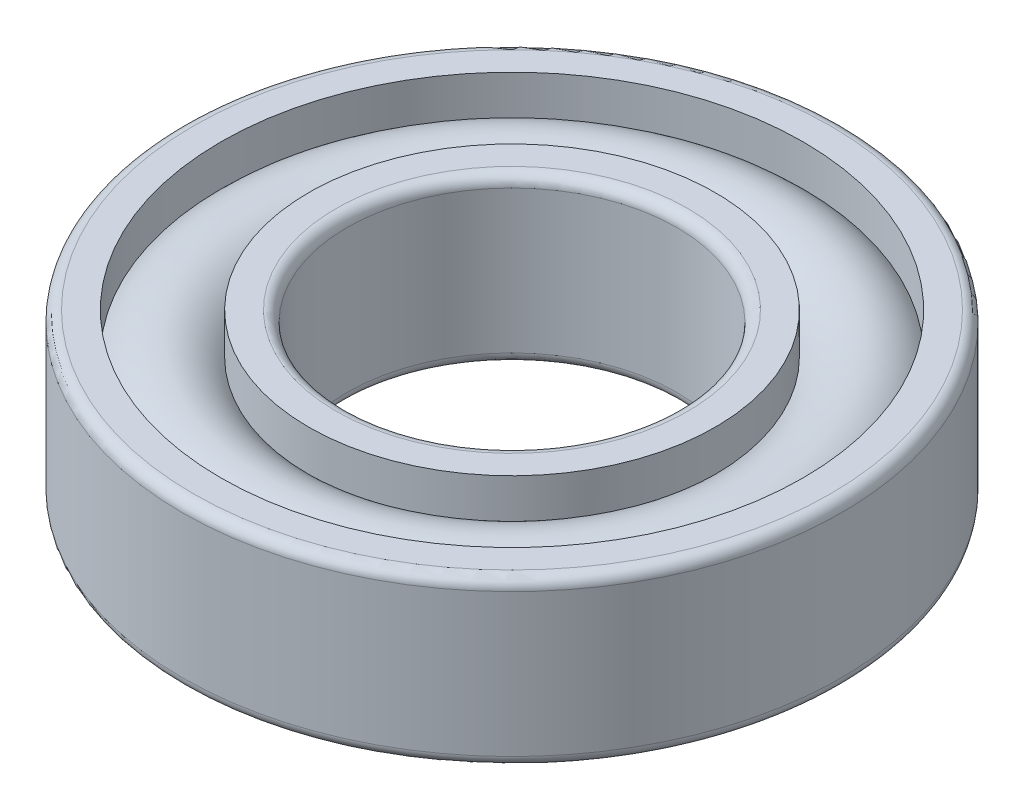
ISO-10303-21;
HEADER;
FILE_DESCRIPTION(('STEP AP214'),'2;1');
FILE_NAME('part.step','',(''),(''),'','','');
FILE_SCHEMA(('AUTOMOTIVE_DESIGN { 1 0 10303 214 1 1 1 1 }'));
ENDSEC;
DATA;
#1=APPLICATION_CONTEXT('core data for automotive mechanical design processes');
#2=APPLICATION_PROTOCOL_DEFINITION('international standard','automotive_design',2000,#1);
#3=PRODUCT_CONTEXT('',#1,'mechanical');
#4=PRODUCT('Part','Part','',(#3));
#5=PRODUCT_RELATED_PRODUCT_CATEGORY('part','',(#4));
#6=PRODUCT_DEFINITION_FORMATION('','',#4);
#7=PRODUCT_DEFINITION_CONTEXT('part definition',#1,'design');
#8=PRODUCT_DEFINITION('design','',#6,#7);
#9=PRODUCT_DEFINITION_SHAPE('','',#8);
#10=(LENGTH_UNIT() NAMED_UNIT(*) SI_UNIT(.MILLI.,.METRE.));
#11=(NAMED_UNIT(*) PLANE_ANGLE_UNIT() SI_UNIT($,.RADIAN.));
#12=(NAMED_UNIT(*) SI_UNIT($,.STERADIAN.) SOLID_ANGLE_UNIT());
#13=UNCERTAINTY_MEASURE_WITH_UNIT(LENGTH_MEASURE(1.E-05),#10,'distance_accuracy_value','');
#14=(GEOMETRIC_REPRESENTATION_CONTEXT(3) GLOBAL_UNCERTAINTY_ASSIGNED_CONTEXT((#13)) GLOBAL_UNIT_ASSIGNED_CONTEXT((#10,
#11,#12)) REPRESENTATION_CONTEXT('',''));
#15=CARTESIAN_POINT('',(0.,0.,0.));
#16=DIRECTION('',(0.,0.,1.));
#17=DIRECTION('',(1.,0.,0.));
#18=AXIS2_PLACEMENT_3D('',#15,#16,#17);
#19=CARTESIAN_POINT('',(0.,-0.15,0.));
#20=DIRECTION('',(0.,1.,0.));
#21=DIRECTION('',(0.,0.,1.));
#22=AXIS2_PLACEMENT_3D('',#19,#20,#21);
#23=CYLINDRICAL_SURFACE('',#22,3.);
#24=CARTESIAN_POINT('',(0.,2.8,0.));
#25=DIRECTION('',(0.,1.,0.));
#26=DIRECTION('',(0.,0.,-1.));
#27=AXIS2_PLACEMENT_3D('',#24,#25,#26);
#28=CIRCLE('',#27,3.);
#29=CARTESIAN_POINT('',(0.,2.8,-3.));
#30=VERTEX_POINT('',#29);
#31=EDGE_CURVE('E60',#30,#30,#28,.F.);
#32=ORIENTED_EDGE('',*,*,#31,.F.);
#33=EDGE_LOOP('',(#32));
#34=FACE_BOUND('',#33,.T.);
#35=CARTESIAN_POINT('',(0.,0.2,0.));
#36=DIRECTION('',(0.,1.,0.));
#37=DIRECTION('',(0.,0.,-1.));
#38=AXIS2_PLACEMENT_3D('',#35,#36,#37);
#39=CIRCLE('',#38,3.);
#40=CARTESIAN_POINT('',(0.,0.2,-3.));
#41=VERTEX_POINT('',#40);
#42=EDGE_CURVE('E283',#41,#41,#39,.T.);
#43=ORIENTED_EDGE('',*,*,#42,.F.);
#44=EDGE_LOOP('',(#43));
#45=FACE_BOUND('',#44,.T.);
#46=ADVANCED_FACE('F16',(#34,#45),#23,.F.);
#47=CARTESIAN_POINT('',(0.,0.2,0.));
#48=DIRECTION('',(0.,1.,0.));
#49=DIRECTION('',(0.,0.,-1.));
#50=AXIS2_PLACEMENT_3D('',#47,#48,#49);
#51=TOROIDAL_SURFACE('',#50,3.2,0.2);
#52=CARTESIAN_POINT('',(0.,0.,0.));
#53=DIRECTION('',(0.,-1.,0.));
#54=DIRECTION('',(0.,0.,-1.));
#55=AXIS2_PLACEMENT_3D('',#52,#53,#54);
#56=CIRCLE('',#55,3.2);
#57=CARTESIAN_POINT('',(0.,0.,-3.2));
#58=VERTEX_POINT('',#57);
#59=CARTESIAN_POINT('',(0.,0.,3.2));
#60=VERTEX_POINT('',#59);
#61=EDGE_CURVE('E55',#58,#60,#56,.T.);
#62=ORIENTED_EDGE('',*,*,#61,.T.);
#63=CARTESIAN_POINT('',(0.,0.,0.));
#64=DIRECTION('',(0.,-1.,0.));
#65=DIRECTION('',(0.,0.,1.));
#66=AXIS2_PLACEMENT_3D('',#63,#64,#65);
#67=CIRCLE('',#66,3.2);
#68=EDGE_CURVE('E52',#60,#58,#67,.T.);
#69=ORIENTED_EDGE('',*,*,#68,.T.);
#70=EDGE_LOOP('',(#62,#69));
#71=FACE_BOUND('',#70,.T.);
#72=ORIENTED_EDGE('',*,*,#42,.T.);
#73=EDGE_LOOP('',(#72));
#74=FACE_BOUND('',#73,.T.);
#75=ADVANCED_FACE('F56',(#71,#74),#51,.T.);
#76=CARTESIAN_POINT('',(0.,2.8,0.));
#77=DIRECTION('',(0.,1.,0.));
#78=DIRECTION('',(0.,0.,-1.));
#79=AXIS2_PLACEMENT_3D('',#76,#77,#78);
#80=TOROIDAL_SURFACE('',#79,3.2,0.2);
#81=ORIENTED_EDGE('',*,*,#31,.T.);
#82=EDGE_LOOP('',(#81));
#83=FACE_BOUND('',#82,.T.);
#84=CARTESIAN_POINT('',(0.,3.,0.));
#85=DIRECTION('',(0.,1.,0.));
#86=DIRECTION('',(0.,0.,-1.));
#87=AXIS2_PLACEMENT_3D('',#84,#85,#86);
#88=CIRCLE('',#87,3.2);
#89=CARTESIAN_POINT('',(0.,3.,3.2));
#90=VERTEX_POINT('',#89);
#91=CARTESIAN_POINT('',(0.,3.,-3.2));
#92=VERTEX_POINT('',#91);
#93=EDGE_CURVE('E249',#90,#92,#88,.F.);
#94=ORIENTED_EDGE('',*,*,#93,.F.);
#95=CARTESIAN_POINT('',(0.,3.,0.));
#96=DIRECTION('',(0.,1.,0.));
#97=DIRECTION('',(0.,0.,1.));
#98=AXIS2_PLACEMENT_3D('',#95,#96,#97);
#99=CIRCLE('',#98,3.2);
#100=EDGE_CURVE('E65',#92,#90,#99,.F.);
#101=ORIENTED_EDGE('',*,*,#100,.F.);
#102=EDGE_LOOP('',(#94,#101));
#103=FACE_BOUND('',#102,.T.);
#104=ADVANCED_FACE('F86',(#83,#103),#80,.T.);
#105=CARTESIAN_POINT('',(0.,0.,0.));
#106=DIRECTION('',(0.,1.,0.));
#107=DIRECTION('',(0.,0.,1.));
#108=AXIS2_PLACEMENT_3D('',#105,#106,#107);
#109=PLANE('',#108);
#110=ORIENTED_EDGE('',*,*,#61,.F.);
#111=ORIENTED_EDGE('',*,*,#68,.F.);
#112=EDGE_LOOP('',(#110,#111));
#113=FACE_BOUND('',#112,.T.);
#114=CARTESIAN_POINT('',(0.,0.,0.));
#115=DIRECTION('',(0.,1.,0.));
#116=DIRECTION('',(0.,0.,1.));
#117=AXIS2_PLACEMENT_3D('',#114,#115,#116);
#118=CIRCLE('',#117,3.7);
#119=CARTESIAN_POINT('',(0.,0.,3.7));
#120=VERTEX_POINT('',#119);
#121=EDGE_CURVE('E258',#120,#120,#118,.T.);
#122=ORIENTED_EDGE('',*,*,#121,.F.);
#123=EDGE_LOOP('',(#122));
#124=FACE_BOUND('',#123,.T.);
#125=ADVANCED_FACE('F63',(#113,#124),#109,.F.);
#126=CARTESIAN_POINT('',(0.,3.,0.));
#127=DIRECTION('',(0.,1.,0.));
#128=DIRECTION('',(0.,0.,1.));
#129=AXIS2_PLACEMENT_3D('',#126,#127,#128);
#130=PLANE('',#129);
#131=ORIENTED_EDGE('',*,*,#100,.T.);
#132=ORIENTED_EDGE('',*,*,#93,.T.);
#133=EDGE_LOOP('',(#131,#132));
#134=FACE_BOUND('',#133,.T.);
#135=CARTESIAN_POINT('',(0.,3.,0.));
#136=DIRECTION('',(0.,1.,0.));
#137=DIRECTION('',(0.,0.,1.));
#138=AXIS2_PLACEMENT_3D('',#135,#136,#137);
#139=CIRCLE('',#138,3.7);
#140=CARTESIAN_POINT('',(0.,3.,3.7));
#141=VERTEX_POINT('',#140);
#142=EDGE_CURVE('E237',#141,#141,#139,.F.);
#143=ORIENTED_EDGE('',*,*,#142,.F.);
#144=EDGE_LOOP('',(#143));
#145=FACE_BOUND('',#144,.T.);
#146=ADVANCED_FACE('F85',(#134,#145),#130,.T.);
#147=CARTESIAN_POINT('',(0.,-0.15,0.));
#148=DIRECTION('',(0.,1.,0.));
#149=DIRECTION('',(0.,0.,1.));
#150=AXIS2_PLACEMENT_3D('',#147,#148,#149);
#151=CYLINDRICAL_SURFACE('',#150,3.7);
#152=ORIENTED_EDGE('',*,*,#121,.T.);
#153=EDGE_LOOP('',(#152));
#154=FACE_BOUND('',#153,.T.);
#155=CARTESIAN_POINT('',(0.,0.745016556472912,0.));
#156=DIRECTION('',(0.,1.,0.));
#157=DIRECTION('',(0.,0.,-1.));
#158=AXIS2_PLACEMENT_3D('',#155,#156,#157);
#159=CIRCLE('',#158,3.70000000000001);
#160=CARTESIAN_POINT('',(0.,0.745016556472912,-3.70000000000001));
#161=VERTEX_POINT('',#160);
#162=EDGE_CURVE('E234',#161,#161,#159,.T.);
#163=ORIENTED_EDGE('',*,*,#162,.F.);
#164=EDGE_LOOP('',(#163));
#165=FACE_BOUND('',#164,.T.);
#166=ADVANCED_FACE('F357',(#154,#165),#151,.T.);
#167=CARTESIAN_POINT('',(0.,-0.15,0.));
#168=DIRECTION('',(0.,1.,0.));
#169=DIRECTION('',(0.,0.,1.));
#170=AXIS2_PLACEMENT_3D('',#167,#168,#169);
#171=CYLINDRICAL_SURFACE('',#170,3.7);
#172=CARTESIAN_POINT('',(0.,2.25498344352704,0.));
#173=DIRECTION('',(0.,1.,0.));
#174=DIRECTION('',(0.,0.,-1.));
#175=AXIS2_PLACEMENT_3D('',#172,#173,#174);
#176=CIRCLE('',#175,3.69999999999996);
#177=CARTESIAN_POINT('',(0.,2.25498344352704,-3.69999999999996));
#178=VERTEX_POINT('',#177);
#179=EDGE_CURVE('E231',#178,#178,#176,.F.);
#180=ORIENTED_EDGE('',*,*,#179,.F.);
#181=EDGE_LOOP('',(#180));
#182=FACE_BOUND('',#181,.T.);
#183=ORIENTED_EDGE('',*,*,#142,.T.);
#184=EDGE_LOOP('',(#183));
#185=FACE_BOUND('',#184,.T.);
#186=ADVANCED_FACE('F226',(#182,#185),#171,.T.);
#187=CARTESIAN_POINT('',(0.,1.5,0.));
#188=DIRECTION('',(0.,1.,0.));
#189=DIRECTION('',(0.,0.,-1.));
#190=AXIS2_PLACEMENT_3D('',#187,#188,#189);
#191=TOROIDAL_SURFACE('',#190,4.5,1.1);
#192=ORIENTED_EDGE('',*,*,#162,.T.);
#193=EDGE_LOOP('',(#192));
#194=FACE_BOUND('',#193,.T.);
#195=CARTESIAN_POINT('',(0.,0.7450165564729,0.));
#196=DIRECTION('',(0.,1.,0.));
#197=DIRECTION('',(0.,0.,1.));
#198=AXIS2_PLACEMENT_3D('',#195,#196,#197);
#199=CIRCLE('',#198,5.3);
#200=CARTESIAN_POINT('',(0.,0.7450165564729,5.3));
#201=VERTEX_POINT('',#200);
#202=EDGE_CURVE('E230',#201,#201,#199,.F.);
#203=ORIENTED_EDGE('',*,*,#202,.T.);
#204=EDGE_LOOP('',(#203));
#205=FACE_BOUND('',#204,.T.);
#206=ADVANCED_FACE('F221',(#194,#205),#191,.T.);
#207=CARTESIAN_POINT('',(0.,1.5,0.));
#208=DIRECTION('',(0.,1.,0.));
#209=DIRECTION('',(0.,0.,-1.));
#210=AXIS2_PLACEMENT_3D('',#207,#208,#209);
#211=TOROIDAL_SURFACE('',#210,4.5,1.1);
#212=CARTESIAN_POINT('',(0.,2.254983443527,0.));
#213=DIRECTION('',(0.,1.,0.));
#214=DIRECTION('',(0.,0.,1.));
#215=AXIS2_PLACEMENT_3D('',#212,#213,#214);
#216=CIRCLE('',#215,5.3);
#217=CARTESIAN_POINT('',(0.,2.254983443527,5.3));
#218=VERTEX_POINT('',#217);
#219=EDGE_CURVE('E214',#218,#218,#216,.T.);
#220=ORIENTED_EDGE('',*,*,#219,.T.);
#221=EDGE_LOOP('',(#220));
#222=FACE_BOUND('',#221,.T.);
#223=ORIENTED_EDGE('',*,*,#179,.T.);
#224=EDGE_LOOP('',(#223));
#225=FACE_BOUND('',#224,.T.);
#226=ADVANCED_FACE('F217',(#222,#225),#211,.T.);
#227=CARTESIAN_POINT('',(0.,-0.15,0.));
#228=DIRECTION('',(0.,1.,0.));
#229=DIRECTION('',(0.,0.,1.));
#230=AXIS2_PLACEMENT_3D('',#227,#228,#229);
#231=CYLINDRICAL_SURFACE('',#230,5.3);
#232=ORIENTED_EDGE('',*,*,#202,.F.);
#233=EDGE_LOOP('',(#232));
#234=FACE_BOUND('',#233,.T.);
#235=CARTESIAN_POINT('',(0.,0.,0.));
#236=DIRECTION('',(0.,1.,0.));
#237=DIRECTION('',(0.,0.,1.));
#238=AXIS2_PLACEMENT_3D('',#235,#236,#237);
#239=CIRCLE('',#238,5.3);
#240=CARTESIAN_POINT('',(0.,0.,5.3));
#241=VERTEX_POINT('',#240);
#242=EDGE_CURVE('E277',#241,#241,#239,.F.);
#243=ORIENTED_EDGE('',*,*,#242,.T.);
#244=EDGE_LOOP('',(#243));
#245=FACE_BOUND('',#244,.T.);
#246=ADVANCED_FACE('F220',(#234,#245),#231,.F.);
#247=CARTESIAN_POINT('',(0.,-0.15,0.));
#248=DIRECTION('',(0.,1.,0.));
#249=DIRECTION('',(0.,0.,1.));
#250=AXIS2_PLACEMENT_3D('',#247,#248,#249);
#251=CYLINDRICAL_SURFACE('',#250,5.3);
#252=CARTESIAN_POINT('',(0.,3.,0.));
#253=DIRECTION('',(0.,1.,0.));
#254=DIRECTION('',(0.,0.,1.));
#255=AXIS2_PLACEMENT_3D('',#252,#253,#254);
#256=CIRCLE('',#255,5.3);
#257=CARTESIAN_POINT('',(0.,3.,5.3));
#258=VERTEX_POINT('',#257);
#259=EDGE_CURVE('E275',#258,#258,#256,.F.);
#260=ORIENTED_EDGE('',*,*,#259,.F.);
#261=EDGE_LOOP('',(#260));
#262=FACE_BOUND('',#261,.T.);
#263=ORIENTED_EDGE('',*,*,#219,.F.);
#264=EDGE_LOOP('',(#263));
#265=FACE_BOUND('',#264,.T.);
#266=ADVANCED_FACE('F188',(#262,#265),#251,.F.);
#267=CARTESIAN_POINT('',(0.,0.,0.));
#268=DIRECTION('',(0.,1.,0.));
#269=DIRECTION('',(0.,0.,1.));
#270=AXIS2_PLACEMENT_3D('',#267,#268,#269);
#271=PLANE('',#270);
#272=ORIENTED_EDGE('',*,*,#242,.F.);
#273=EDGE_LOOP('',(#272));
#274=FACE_BOUND('',#273,.T.);
#275=CARTESIAN_POINT('',(0.,0.,0.));
#276=DIRECTION('',(0.,1.,0.));
#277=DIRECTION('',(0.,0.,-1.));
#278=AXIS2_PLACEMENT_3D('',#275,#276,#277);
#279=CIRCLE('',#278,5.8);
#280=CARTESIAN_POINT('',(0.,0.,-5.8));
#281=VERTEX_POINT('',#280);
#282=CARTESIAN_POINT('',(0.,0.,5.8));
#283=VERTEX_POINT('',#282);
#284=EDGE_CURVE('E173',#281,#283,#279,.T.);
#285=ORIENTED_EDGE('',*,*,#284,.F.);
#286=CARTESIAN_POINT('',(0.,0.,0.));
#287=DIRECTION('',(0.,1.,0.));
#288=DIRECTION('',(0.,0.,1.));
#289=AXIS2_PLACEMENT_3D('',#286,#287,#288);
#290=CIRCLE('',#289,5.8);
#291=EDGE_CURVE('E201',#283,#281,#290,.T.);
#292=ORIENTED_EDGE('',*,*,#291,.F.);
#293=EDGE_LOOP('',(#285,#292));
#294=FACE_BOUND('',#293,.T.);
#295=ADVANCED_FACE('F179',(#274,#294),#271,.F.);
#296=CARTESIAN_POINT('',(0.,3.,0.));
#297=DIRECTION('',(0.,1.,0.));
#298=DIRECTION('',(0.,0.,1.));
#299=AXIS2_PLACEMENT_3D('',#296,#297,#298);
#300=PLANE('',#299);
#301=ORIENTED_EDGE('',*,*,#259,.T.);
#302=EDGE_LOOP('',(#301));
#303=FACE_BOUND('',#302,.T.);
#304=CARTESIAN_POINT('',(0.,3.,0.));
#305=DIRECTION('',(0.,-1.,0.));
#306=DIRECTION('',(0.,0.,1.));
#307=AXIS2_PLACEMENT_3D('',#304,#305,#306);
#308=CIRCLE('',#307,5.8);
#309=CARTESIAN_POINT('',(0.,3.,5.8));
#310=VERTEX_POINT('',#309);
#311=CARTESIAN_POINT('',(0.,3.,-5.8));
#312=VERTEX_POINT('',#311);
#313=EDGE_CURVE('E34',#310,#312,#308,.T.);
#314=ORIENTED_EDGE('',*,*,#313,.F.);
#315=CARTESIAN_POINT('',(0.,3.,0.));
#316=DIRECTION('',(0.,-1.,0.));
#317=DIRECTION('',(0.,0.,-1.));
#318=AXIS2_PLACEMENT_3D('',#315,#316,#317);
#319=CIRCLE('',#318,5.8);
#320=EDGE_CURVE('E150',#312,#310,#319,.T.);
#321=ORIENTED_EDGE('',*,*,#320,.F.);
#322=EDGE_LOOP('',(#314,#321));
#323=FACE_BOUND('',#322,.T.);
#324=ADVANCED_FACE('F129',(#303,#323),#300,.T.);
#325=CARTESIAN_POINT('',(0.,0.2,0.));
#326=DIRECTION('',(0.,1.,0.));
#327=DIRECTION('',(0.,0.,-1.));
#328=AXIS2_PLACEMENT_3D('',#325,#326,#327);
#329=TOROIDAL_SURFACE('',#328,5.8,0.2);
#330=CARTESIAN_POINT('',(0.,0.2,0.));
#331=DIRECTION('',(0.,1.,0.));
#332=DIRECTION('',(0.,0.,1.));
#333=AXIS2_PLACEMENT_3D('',#330,#331,#332);
#334=CIRCLE('',#333,6.);
#335=CARTESIAN_POINT('',(0.,0.2,6.));
#336=VERTEX_POINT('',#335);
#337=EDGE_CURVE('E26',#336,#336,#334,.T.);
#338=ORIENTED_EDGE('',*,*,#337,.F.);
#339=EDGE_LOOP('',(#338));
#340=FACE_BOUND('',#339,.T.);
#341=ORIENTED_EDGE('',*,*,#291,.T.);
#342=ORIENTED_EDGE('',*,*,#284,.T.);
#343=EDGE_LOOP('',(#341,#342));
#344=FACE_BOUND('',#343,.T.);
#345=ADVANCED_FACE('F117',(#340,#344),#329,.T.);
#346=CARTESIAN_POINT('',(0.,2.8,0.));
#347=DIRECTION('',(0.,1.,0.));
#348=DIRECTION('',(0.,0.,-1.));
#349=AXIS2_PLACEMENT_3D('',#346,#347,#348);
#350=TOROIDAL_SURFACE('',#349,5.8,0.2);
#351=ORIENTED_EDGE('',*,*,#313,.T.);
#352=ORIENTED_EDGE('',*,*,#320,.T.);
#353=EDGE_LOOP('',(#351,#352));
#354=FACE_BOUND('',#353,.T.);
#355=CARTESIAN_POINT('',(0.,2.8,0.));
#356=DIRECTION('',(0.,1.,0.));
#357=DIRECTION('',(0.,0.,1.));
#358=AXIS2_PLACEMENT_3D('',#355,#356,#357);
#359=CIRCLE('',#358,6.);
#360=CARTESIAN_POINT('',(0.,2.8,6.));
#361=VERTEX_POINT('',#360);
#362=EDGE_CURVE('E11',#361,#361,#359,.F.);
#363=ORIENTED_EDGE('',*,*,#362,.F.);
#364=EDGE_LOOP('',(#363));
#365=FACE_BOUND('',#364,.T.);
#366=ADVANCED_FACE('F128',(#354,#365),#350,.T.);
#367=CARTESIAN_POINT('',(0.,-0.15,0.));
#368=DIRECTION('',(0.,1.,0.));
#369=DIRECTION('',(0.,0.,1.));
#370=AXIS2_PLACEMENT_3D('',#367,#368,#369);
#371=CYLINDRICAL_SURFACE('',#370,6.);
#372=ORIENTED_EDGE('',*,*,#362,.T.);
#373=EDGE_LOOP('',(#372));
#374=FACE_BOUND('',#373,.T.);
#375=ORIENTED_EDGE('',*,*,#337,.T.);
#376=EDGE_LOOP('',(#375));
#377=FACE_BOUND('',#376,.T.);
#378=ADVANCED_FACE('F305',(#374,#377),#371,.T.);
#379=CLOSED_SHELL('',(#46,#75,#104,#125,#146,#166,#186,#206,#226,#246,#266,#295,#324,#345,#366,#378));
#380=MANIFOLD_SOLID_BREP('B1',#379);
#381=ADVANCED_BREP_SHAPE_REPRESENTATION('',(#18,#380),#14);
#382=SHAPE_DEFINITION_REPRESENTATION(#9,#381);
ENDSEC;
END-ISO-10303-21;
